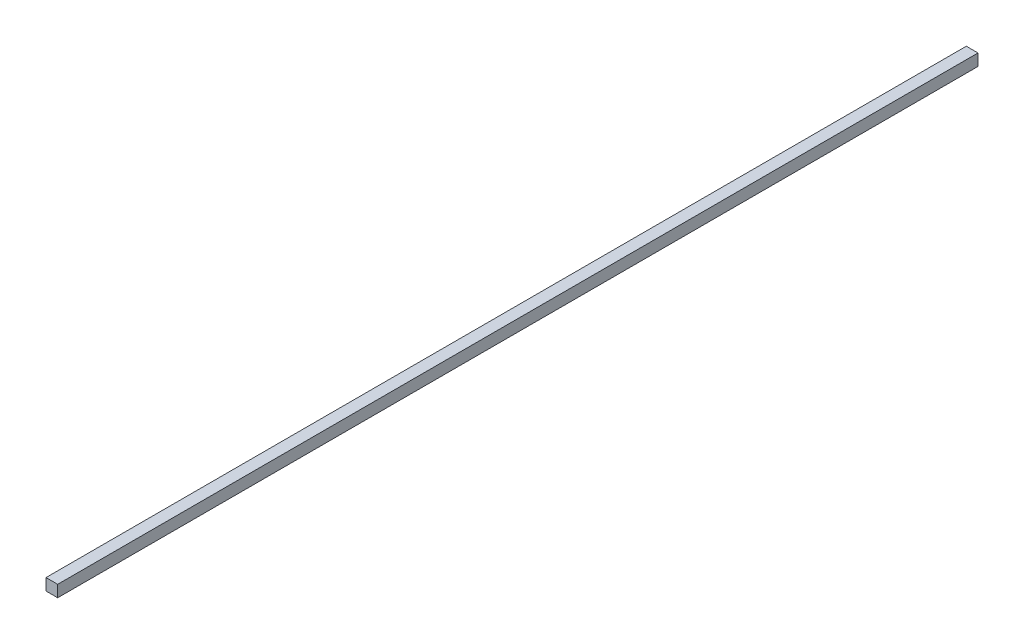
ISO-10303-21;
HEADER;
FILE_DESCRIPTION(('STEP AP214'),'2;1');
FILE_NAME('part.step','',(''),(''),'','','');
FILE_SCHEMA(('AUTOMOTIVE_DESIGN { 1 0 10303 214 1 1 1 1 }'));
ENDSEC;
DATA;
#1=APPLICATION_CONTEXT('core data for automotive mechanical design processes');
#2=APPLICATION_PROTOCOL_DEFINITION('international standard','automotive_design',2000,#1);
#3=PRODUCT_CONTEXT('',#1,'mechanical');
#4=PRODUCT('Part','Part','',(#3));
#5=PRODUCT_RELATED_PRODUCT_CATEGORY('part','',(#4));
#6=PRODUCT_DEFINITION_FORMATION('','',#4);
#7=PRODUCT_DEFINITION_CONTEXT('part definition',#1,'design');
#8=PRODUCT_DEFINITION('design','',#6,#7);
#9=PRODUCT_DEFINITION_SHAPE('','',#8);
#10=(LENGTH_UNIT() NAMED_UNIT(*) SI_UNIT(.MILLI.,.METRE.));
#11=(NAMED_UNIT(*) PLANE_ANGLE_UNIT() SI_UNIT($,.RADIAN.));
#12=(NAMED_UNIT(*) SI_UNIT($,.STERADIAN.) SOLID_ANGLE_UNIT());
#13=UNCERTAINTY_MEASURE_WITH_UNIT(LENGTH_MEASURE(1.E-05),#10,'distance_accuracy_value','');
#14=(GEOMETRIC_REPRESENTATION_CONTEXT(3) GLOBAL_UNCERTAINTY_ASSIGNED_CONTEXT((#13)) GLOBAL_UNIT_ASSIGNED_CONTEXT((#10,
#11,#12)) REPRESENTATION_CONTEXT('',''));
#15=CARTESIAN_POINT('',(0.,0.,0.));
#16=DIRECTION('',(0.,0.,1.));
#17=DIRECTION('',(1.,0.,0.));
#18=AXIS2_PLACEMENT_3D('',#15,#16,#17);
#19=CARTESIAN_POINT('',(0.,0.,999.998));
#20=DIRECTION('',(1.,0.,0.));
#21=DIRECTION('',(0.,0.,-1.));
#22=AXIS2_PLACEMENT_3D('',#19,#20,#21);
#23=PLANE('',#22);
#24=DIRECTION('',(0.,-1.,0.));
#25=VECTOR('',#24,1.);
#26=CARTESIAN_POINT('',(0.,0.,0.));
#27=LINE('',#26,#25);
#28=CARTESIAN_POINT('',(0.,12.7,0.));
#29=VERTEX_POINT('',#28);
#30=CARTESIAN_POINT('',(0.,0.,0.));
#31=VERTEX_POINT('',#30);
#32=EDGE_CURVE('E94',#29,#31,#27,.T.);
#33=ORIENTED_EDGE('',*,*,#32,.T.);
#34=DIRECTION('',(0.,0.,-1.));
#35=VECTOR('',#34,1.);
#36=CARTESIAN_POINT('',(0.,0.,999.998));
#37=LINE('',#36,#35);
#38=CARTESIAN_POINT('',(0.,0.,999.998));
#39=VERTEX_POINT('',#38);
#40=EDGE_CURVE('E11',#39,#31,#37,.T.);
#41=ORIENTED_EDGE('',*,*,#40,.F.);
#42=DIRECTION('',(0.,-1.,0.));
#43=VECTOR('',#42,1.);
#44=CARTESIAN_POINT('',(0.,0.,999.998));
#45=LINE('',#44,#43);
#46=CARTESIAN_POINT('',(0.,12.7,999.998));
#47=VERTEX_POINT('',#46);
#48=EDGE_CURVE('E82',#47,#39,#45,.T.);
#49=ORIENTED_EDGE('',*,*,#48,.F.);
#50=DIRECTION('',(0.,0.,-1.));
#51=VECTOR('',#50,1.);
#52=CARTESIAN_POINT('',(0.,12.7,999.998));
#53=LINE('',#52,#51);
#54=EDGE_CURVE('E90',#47,#29,#53,.T.);
#55=ORIENTED_EDGE('',*,*,#54,.T.);
#56=EDGE_LOOP('',(#33,#41,#49,#55));
#57=FACE_BOUND('',#56,.T.);
#58=ADVANCED_FACE('F31',(#57),#23,.F.);
#59=CARTESIAN_POINT('',(0.,0.,999.998));
#60=DIRECTION('',(0.,1.,0.));
#61=DIRECTION('',(0.,0.,1.));
#62=AXIS2_PLACEMENT_3D('',#59,#60,#61);
#63=PLANE('',#62);
#64=DIRECTION('',(1.,0.,0.));
#65=VECTOR('',#64,1.);
#66=CARTESIAN_POINT('',(0.,0.,0.));
#67=LINE('',#66,#65);
#68=CARTESIAN_POINT('',(12.7,0.,0.));
#69=VERTEX_POINT('',#68);
#70=EDGE_CURVE('E86',#31,#69,#67,.T.);
#71=ORIENTED_EDGE('',*,*,#70,.T.);
#72=DIRECTION('',(0.,0.,-1.));
#73=VECTOR('',#72,1.);
#74=CARTESIAN_POINT('',(12.7,0.,999.998));
#75=LINE('',#74,#73);
#76=CARTESIAN_POINT('',(12.7,0.,999.998));
#77=VERTEX_POINT('',#76);
#78=EDGE_CURVE('E39',#77,#69,#75,.T.);
#79=ORIENTED_EDGE('',*,*,#78,.F.);
#80=DIRECTION('',(1.,0.,0.));
#81=VECTOR('',#80,1.);
#82=CARTESIAN_POINT('',(0.,0.,999.998));
#83=LINE('',#82,#81);
#84=EDGE_CURVE('E77',#39,#77,#83,.T.);
#85=ORIENTED_EDGE('',*,*,#84,.F.);
#86=ORIENTED_EDGE('',*,*,#40,.T.);
#87=EDGE_LOOP('',(#71,#79,#85,#86));
#88=FACE_BOUND('',#87,.T.);
#89=ADVANCED_FACE('F85',(#88),#63,.F.);
#90=CARTESIAN_POINT('',(12.7,0.,999.998));
#91=DIRECTION('',(-1.,0.,0.));
#92=DIRECTION('',(0.,0.,1.));
#93=AXIS2_PLACEMENT_3D('',#90,#91,#92);
#94=PLANE('',#93);
#95=DIRECTION('',(0.,1.,0.));
#96=VECTOR('',#95,1.);
#97=CARTESIAN_POINT('',(12.7,0.,0.));
#98=LINE('',#97,#96);
#99=CARTESIAN_POINT('',(12.7,12.7,0.));
#100=VERTEX_POINT('',#99);
#101=EDGE_CURVE('E64',#69,#100,#98,.T.);
#102=ORIENTED_EDGE('',*,*,#101,.T.);
#103=DIRECTION('',(0.,0.,-1.));
#104=VECTOR('',#103,1.);
#105=CARTESIAN_POINT('',(12.7,12.7,999.998));
#106=LINE('',#105,#104);
#107=CARTESIAN_POINT('',(12.7,12.7,999.998));
#108=VERTEX_POINT('',#107);
#109=EDGE_CURVE('E87',#108,#100,#106,.T.);
#110=ORIENTED_EDGE('',*,*,#109,.F.);
#111=DIRECTION('',(0.,1.,0.));
#112=VECTOR('',#111,1.);
#113=CARTESIAN_POINT('',(12.7,0.,999.998));
#114=LINE('',#113,#112);
#115=EDGE_CURVE('E80',#77,#108,#114,.T.);
#116=ORIENTED_EDGE('',*,*,#115,.F.);
#117=ORIENTED_EDGE('',*,*,#78,.T.);
#118=EDGE_LOOP('',(#102,#110,#116,#117));
#119=FACE_BOUND('',#118,.T.);
#120=ADVANCED_FACE('F88',(#119),#94,.F.);
#121=CARTESIAN_POINT('',(0.,12.7,999.998));
#122=DIRECTION('',(0.,-1.,0.));
#123=DIRECTION('',(0.,0.,-1.));
#124=AXIS2_PLACEMENT_3D('',#121,#122,#123);
#125=PLANE('',#124);
#126=DIRECTION('',(-1.,0.,0.));
#127=VECTOR('',#126,1.);
#128=CARTESIAN_POINT('',(0.,12.7,0.));
#129=LINE('',#128,#127);
#130=EDGE_CURVE('E70',#100,#29,#129,.T.);
#131=ORIENTED_EDGE('',*,*,#130,.T.);
#132=ORIENTED_EDGE('',*,*,#54,.F.);
#133=DIRECTION('',(-1.,0.,0.));
#134=VECTOR('',#133,1.);
#135=CARTESIAN_POINT('',(0.,12.7,999.998));
#136=LINE('',#135,#134);
#137=EDGE_CURVE('E47',#108,#47,#136,.T.);
#138=ORIENTED_EDGE('',*,*,#137,.F.);
#139=ORIENTED_EDGE('',*,*,#109,.T.);
#140=EDGE_LOOP('',(#131,#132,#138,#139));
#141=FACE_BOUND('',#140,.T.);
#142=ADVANCED_FACE('F101',(#141),#125,.F.);
#143=CARTESIAN_POINT('',(0.,12.7,999.998));
#144=DIRECTION('',(0.,0.,-1.));
#145=DIRECTION('',(-1.,0.,0.));
#146=AXIS2_PLACEMENT_3D('',#143,#144,#145);
#147=PLANE('',#146);
#148=ORIENTED_EDGE('',*,*,#48,.T.);
#149=ORIENTED_EDGE('',*,*,#84,.T.);
#150=ORIENTED_EDGE('',*,*,#115,.T.);
#151=ORIENTED_EDGE('',*,*,#137,.T.);
#152=EDGE_LOOP('',(#148,#149,#150,#151));
#153=FACE_BOUND('',#152,.T.);
#154=ADVANCED_FACE('F78',(#153),#147,.F.);
#155=CARTESIAN_POINT('',(0.,12.7,0.));
#156=DIRECTION('',(0.,0.,-1.));
#157=DIRECTION('',(-1.,0.,0.));
#158=AXIS2_PLACEMENT_3D('',#155,#156,#157);
#159=PLANE('',#158);
#160=ORIENTED_EDGE('',*,*,#32,.F.);
#161=ORIENTED_EDGE('',*,*,#130,.F.);
#162=ORIENTED_EDGE('',*,*,#101,.F.);
#163=ORIENTED_EDGE('',*,*,#70,.F.);
#164=EDGE_LOOP('',(#160,#161,#162,#163));
#165=FACE_BOUND('',#164,.T.);
#166=ADVANCED_FACE('F104',(#165),#159,.T.);
#167=CLOSED_SHELL('',(#58,#89,#120,#142,#154,#166));
#168=MANIFOLD_SOLID_BREP('B2',#167);
#169=ADVANCED_BREP_SHAPE_REPRESENTATION('',(#18,#168),#14);
#170=SHAPE_DEFINITION_REPRESENTATION(#9,#169);
ENDSEC;
END-ISO-10303-21;
